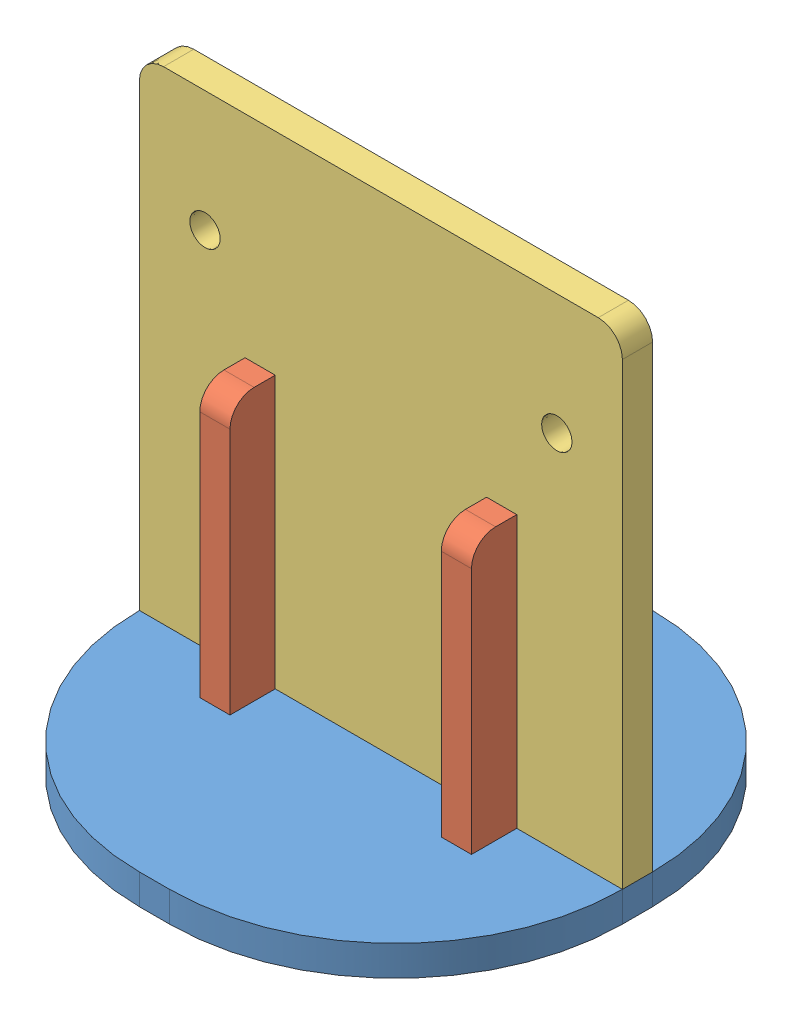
SolidWorks assembly ScoutTurretAssembly.SLDASM, configuration Default (file format 4400). Lengths in mm.
Overall size (50.8 53.98 50.8).
4 component instances, 3 part files, 9 mates.
Components (placement in the parent):
- TurretBase-1: TurretBase.SLDPRT [Default] at (-1.923 -6.1256 5.1764) size (50.8 3.17 50.8)
- TurretSupport-1: TurretSupport.SLDPRT [Default] at (10.777 8.1619 5.1764) x (0 0 1) z (-1 0 0) size (12.7 31.75 3.17)
- TurretSupport-2: TurretSupport.SLDPRT [Default] at (-14.623 8.1619 5.1764) x (0 0 1) z (-1 0 0) size (12.7 31.75 3.17)
- TurretPanel-1: TurretPanel.SLDPRT [Default] at (-1.923 20.8619 5.1764) size (50.8 50.8 3.17)
Mates (geometry in assembly coordinates):
- Coincident1: coincident anti-aligned: plane of TurretBase-1 through (9.1895 -7.7131 2.0014) normal (1 0 0); plane of TurretSupport-1 through (9.1895 -7.7131 11.5264) normal (-1 0 0)
- Coincident2: coincident anti-aligned: plane of TurretBase-1 through (-16.2105 -7.7131 2.0014) normal (1 0 0); plane of TurretSupport-2 through (-16.2105 -7.7131 11.5264) normal (-1 0 0)
- Coincident3: coincident anti-aligned: plane of TurretBase-1 through (12.3645 -7.7131 8.3514) normal (0 0 -1); plane of TurretSupport-1 through (12.3645 -7.7131 8.3514) normal (0 0 1)
- Coincident4: coincident anti-aligned: plane of TurretBase-1 through (-16.2105 -7.7131 8.3514) normal (0 0 -1); plane of TurretSupport-2 through (-13.0355 -7.7131 8.3514) normal (0 0 1)
- Coincident5: coincident aligned: plane of TurretBase-1 through (23.477 -7.7131 30.5764) normal (0 -1 0); plane of TurretSupport-2 through (-16.2105 -7.7131 -1.1736) normal (0 -1 0)
- Coincident6: coincident aligned: plane of TurretBase-1 through (23.477 -7.7131 30.5764) normal (0 -1 0); plane of TurretSupport-1 through (9.1895 -7.7131 -1.1736) normal (0 -1 0)
- Coincident7: coincident anti-aligned: plane of TurretSupport-2 through (-13.0355 24.0369 6.7639) normal (0 0 -1); plane of TurretPanel-1 through (23.477 -4.5381 6.7639) normal (0 0 1)
- Coincident8: coincident anti-aligned: plane of TurretSupport-1 through (12.3645 20.8619 3.5889) normal (0 1 0); plane of TurretPanel-1 through (12.3645 20.8619 3.5889) normal (0 -1 0)
- Coincident9: coincident anti-aligned: plane of TurretSupport-1 through (12.3645 -7.7131 11.5264) normal (1 0 0); plane of TurretPanel-1 through (12.3645 20.8619 3.5889) normal (-1 0 0)
